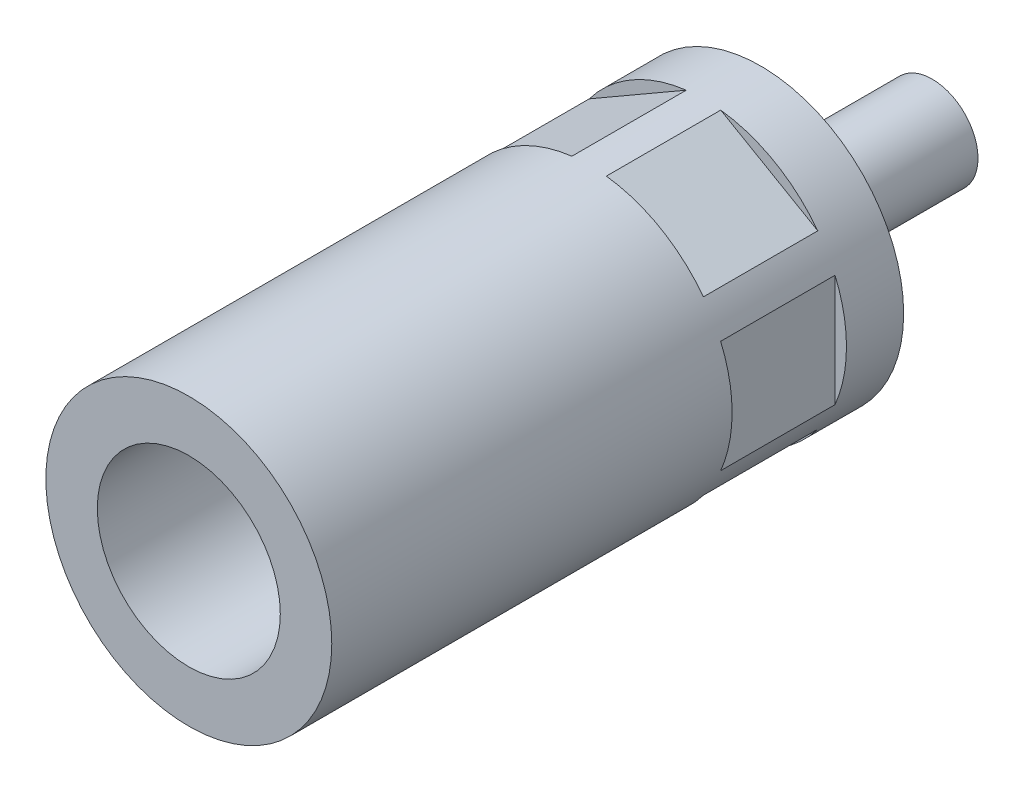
ISO-10303-21;
HEADER;
FILE_DESCRIPTION(('STEP AP214'),'2;1');
FILE_NAME('part.step','',(''),(''),'','','');
FILE_SCHEMA(('AUTOMOTIVE_DESIGN { 1 0 10303 214 1 1 1 1 }'));
ENDSEC;
DATA;
#1=APPLICATION_CONTEXT('core data for automotive mechanical design processes');
#2=APPLICATION_PROTOCOL_DEFINITION('international standard','automotive_design',2000,#1);
#3=PRODUCT_CONTEXT('',#1,'mechanical');
#4=PRODUCT('Part','Part','',(#3));
#5=PRODUCT_RELATED_PRODUCT_CATEGORY('part','',(#4));
#6=PRODUCT_DEFINITION_FORMATION('','',#4);
#7=PRODUCT_DEFINITION_CONTEXT('part definition',#1,'design');
#8=PRODUCT_DEFINITION('design','',#6,#7);
#9=PRODUCT_DEFINITION_SHAPE('','',#8);
#10=(LENGTH_UNIT() NAMED_UNIT(*) SI_UNIT(.MILLI.,.METRE.));
#11=(NAMED_UNIT(*) PLANE_ANGLE_UNIT() SI_UNIT($,.RADIAN.));
#12=(NAMED_UNIT(*) SI_UNIT($,.STERADIAN.) SOLID_ANGLE_UNIT());
#13=UNCERTAINTY_MEASURE_WITH_UNIT(LENGTH_MEASURE(1.E-05),#10,'distance_accuracy_value','');
#14=(GEOMETRIC_REPRESENTATION_CONTEXT(3) GLOBAL_UNCERTAINTY_ASSIGNED_CONTEXT((#13)) GLOBAL_UNIT_ASSIGNED_CONTEXT((#10,
#11,#12)) REPRESENTATION_CONTEXT('',''));
#15=CARTESIAN_POINT('',(0.,0.,0.));
#16=DIRECTION('',(0.,0.,1.));
#17=DIRECTION('',(1.,0.,0.));
#18=AXIS2_PLACEMENT_3D('',#15,#16,#17);
#19=CARTESIAN_POINT('',(0.,0.,80.));
#20=DIRECTION('',(0.,0.,1.));
#21=DIRECTION('',(1.,0.,0.));
#22=AXIS2_PLACEMENT_3D('',#19,#20,#21);
#23=CYLINDRICAL_SURFACE('',#22,25.);
#24=CARTESIAN_POINT('',(0.,0.,10.));
#25=DIRECTION('',(0.,0.,1.));
#26=DIRECTION('',(1.,0.,0.));
#27=AXIS2_PLACEMENT_3D('',#24,#25,#26);
#28=CIRCLE('',#27,25.);
#29=CARTESIAN_POINT('',(-19.9852813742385,-15.0196048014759,10.));
#30=VERTEX_POINT('',#29);
#31=CARTESIAN_POINT('',(-3.01471862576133,-24.8175637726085,10.));
#32=VERTEX_POINT('',#31);
#33=EDGE_CURVE('E153',#30,#32,#28,.T.);
#34=ORIENTED_EDGE('',*,*,#33,.F.);
#35=DIRECTION('',(0.,0.,1.));
#36=VECTOR('',#35,1.);
#37=CARTESIAN_POINT('',(-19.9852813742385,-15.0196048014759,80.));
#38=LINE('',#37,#36);
#39=CARTESIAN_POINT('',(-19.9852813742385,-15.0196048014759,30.));
#40=VERTEX_POINT('',#39);
#41=EDGE_CURVE('E9',#30,#40,#38,.T.);
#42=ORIENTED_EDGE('',*,*,#41,.T.);
#43=CARTESIAN_POINT('',(0.,0.,30.));
#44=DIRECTION('',(0.,0.,1.));
#45=DIRECTION('',(1.,0.,0.));
#46=AXIS2_PLACEMENT_3D('',#43,#44,#45);
#47=CIRCLE('',#46,25.);
#48=CARTESIAN_POINT('',(-3.01471862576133,-24.8175637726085,30.));
#49=VERTEX_POINT('',#48);
#50=EDGE_CURVE('E22',#40,#49,#47,.T.);
#51=ORIENTED_EDGE('',*,*,#50,.T.);
#52=DIRECTION('',(0.,0.,1.));
#53=VECTOR('',#52,1.);
#54=CARTESIAN_POINT('',(-3.01471862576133,-24.8175637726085,80.));
#55=LINE('',#54,#53);
#56=EDGE_CURVE('E150',#49,#32,#55,.F.);
#57=ORIENTED_EDGE('',*,*,#56,.T.);
#58=EDGE_LOOP('',(#34,#42,#51,#57));
#59=FACE_BOUND('',#58,.T.);
#60=DIRECTION('',(0.,0.,1.));
#61=VECTOR('',#60,1.);
#62=CARTESIAN_POINT('',(23.,9.79795897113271,80.));
#63=LINE('',#62,#61);
#64=CARTESIAN_POINT('',(23.,9.79795897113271,10.));
#65=VERTEX_POINT('',#64);
#66=CARTESIAN_POINT('',(23.,9.79795897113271,30.));
#67=VERTEX_POINT('',#66);
#68=EDGE_CURVE('E143',#65,#67,#63,.T.);
#69=ORIENTED_EDGE('',*,*,#68,.F.);
#70=CARTESIAN_POINT('',(23.,-9.79795897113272,10.));
#71=VERTEX_POINT('',#70);
#72=EDGE_CURVE('E142',#71,#65,#28,.T.);
#73=ORIENTED_EDGE('',*,*,#72,.F.);
#74=DIRECTION('',(0.,0.,1.));
#75=VECTOR('',#74,1.);
#76=CARTESIAN_POINT('',(23.,-9.79795897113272,80.));
#77=LINE('',#76,#75);
#78=CARTESIAN_POINT('',(23.,-9.79795897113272,30.));
#79=VERTEX_POINT('',#78);
#80=EDGE_CURVE('E139',#79,#71,#77,.F.);
#81=ORIENTED_EDGE('',*,*,#80,.F.);
#82=EDGE_CURVE('E146',#79,#67,#47,.T.);
#83=ORIENTED_EDGE('',*,*,#82,.T.);
#84=EDGE_LOOP('',(#69,#73,#81,#83));
#85=FACE_BOUND('',#84,.T.);
#86=CARTESIAN_POINT('',(19.9852813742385,15.0196048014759,10.));
#87=VERTEX_POINT('',#86);
#88=CARTESIAN_POINT('',(3.01471862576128,24.8175637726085,10.));
#89=VERTEX_POINT('',#88);
#90=EDGE_CURVE('E135',#87,#89,#28,.T.);
#91=ORIENTED_EDGE('',*,*,#90,.F.);
#92=DIRECTION('',(0.,0.,1.));
#93=VECTOR('',#92,1.);
#94=CARTESIAN_POINT('',(19.9852813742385,15.0196048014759,80.));
#95=LINE('',#94,#93);
#96=CARTESIAN_POINT('',(19.9852813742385,15.0196048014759,30.));
#97=VERTEX_POINT('',#96);
#98=EDGE_CURVE('E136',#87,#97,#95,.T.);
#99=ORIENTED_EDGE('',*,*,#98,.T.);
#100=CARTESIAN_POINT('',(3.01471862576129,24.8175637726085,30.));
#101=VERTEX_POINT('',#100);
#102=EDGE_CURVE('E140',#97,#101,#47,.T.);
#103=ORIENTED_EDGE('',*,*,#102,.T.);
#104=DIRECTION('',(0.,0.,1.));
#105=VECTOR('',#104,1.);
#106=CARTESIAN_POINT('',(3.01471862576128,24.8175637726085,80.));
#107=LINE('',#106,#105);
#108=EDGE_CURVE('E132',#101,#89,#107,.F.);
#109=ORIENTED_EDGE('',*,*,#108,.T.);
#110=EDGE_LOOP('',(#91,#99,#103,#109));
#111=FACE_BOUND('',#110,.T.);
#112=CARTESIAN_POINT('',(0.,0.,0.));
#113=DIRECTION('',(0.,0.,1.));
#114=DIRECTION('',(1.,0.,0.));
#115=AXIS2_PLACEMENT_3D('',#112,#113,#114);
#116=CIRCLE('',#115,25.);
#117=CARTESIAN_POINT('',(25.,0.,0.));
#118=VERTEX_POINT('',#117);
#119=EDGE_CURVE('E202',#118,#118,#116,.T.);
#120=ORIENTED_EDGE('',*,*,#119,.T.);
#121=EDGE_LOOP('',(#120));
#122=FACE_BOUND('',#121,.T.);
#123=CARTESIAN_POINT('',(0.,0.,100.));
#124=DIRECTION('',(0.,0.,1.));
#125=DIRECTION('',(1.,0.,0.));
#126=AXIS2_PLACEMENT_3D('',#123,#124,#125);
#127=CIRCLE('',#126,25.);
#128=CARTESIAN_POINT('',(25.,0.,100.));
#129=VERTEX_POINT('',#128);
#130=EDGE_CURVE('E205',#129,#129,#127,.T.);
#131=ORIENTED_EDGE('',*,*,#130,.F.);
#132=EDGE_LOOP('',(#131));
#133=FACE_BOUND('',#132,.T.);
#134=CARTESIAN_POINT('',(-23.,9.79795897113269,10.));
#135=VERTEX_POINT('',#134);
#136=CARTESIAN_POINT('',(-23.,-9.79795897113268,10.));
#137=VERTEX_POINT('',#136);
#138=EDGE_CURVE('E111',#135,#137,#28,.T.);
#139=ORIENTED_EDGE('',*,*,#138,.F.);
#140=DIRECTION('',(0.,0.,1.));
#141=VECTOR('',#140,1.);
#142=CARTESIAN_POINT('',(-23.,9.79795897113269,80.));
#143=LINE('',#142,#141);
#144=CARTESIAN_POINT('',(-23.,9.79795897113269,30.));
#145=VERTEX_POINT('',#144);
#146=EDGE_CURVE('E110',#135,#145,#143,.T.);
#147=ORIENTED_EDGE('',*,*,#146,.T.);
#148=CARTESIAN_POINT('',(-23.,-9.79795897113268,30.));
#149=VERTEX_POINT('',#148);
#150=EDGE_CURVE('E103',#145,#149,#47,.T.);
#151=ORIENTED_EDGE('',*,*,#150,.T.);
#152=DIRECTION('',(0.,0.,1.));
#153=VECTOR('',#152,1.);
#154=CARTESIAN_POINT('',(-23.,-9.79795897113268,80.));
#155=LINE('',#154,#153);
#156=EDGE_CURVE('E117',#149,#137,#155,.F.);
#157=ORIENTED_EDGE('',*,*,#156,.T.);
#158=EDGE_LOOP('',(#139,#147,#151,#157));
#159=FACE_BOUND('',#158,.T.);
#160=DIRECTION('',(0.,0.,1.));
#161=VECTOR('',#160,1.);
#162=CARTESIAN_POINT('',(-19.9852813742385,15.0196048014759,80.));
#163=LINE('',#162,#161);
#164=CARTESIAN_POINT('',(-19.9852813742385,15.0196048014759,10.));
#165=VERTEX_POINT('',#164);
#166=CARTESIAN_POINT('',(-19.9852813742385,15.0196048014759,30.));
#167=VERTEX_POINT('',#166);
#168=EDGE_CURVE('E130',#165,#167,#163,.T.);
#169=ORIENTED_EDGE('',*,*,#168,.F.);
#170=CARTESIAN_POINT('',(-3.0147186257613,24.8175637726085,10.));
#171=VERTEX_POINT('',#170);
#172=EDGE_CURVE('E126',#171,#165,#28,.T.);
#173=ORIENTED_EDGE('',*,*,#172,.F.);
#174=DIRECTION('',(0.,0.,1.));
#175=VECTOR('',#174,1.);
#176=CARTESIAN_POINT('',(-3.0147186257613,24.8175637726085,80.));
#177=LINE('',#176,#175);
#178=CARTESIAN_POINT('',(-3.0147186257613,24.8175637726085,30.));
#179=VERTEX_POINT('',#178);
#180=EDGE_CURVE('E124',#179,#171,#177,.F.);
#181=ORIENTED_EDGE('',*,*,#180,.F.);
#182=EDGE_CURVE('E113',#179,#167,#47,.T.);
#183=ORIENTED_EDGE('',*,*,#182,.T.);
#184=EDGE_LOOP('',(#169,#173,#181,#183));
#185=FACE_BOUND('',#184,.T.);
#186=DIRECTION('',(0.,0.,1.));
#187=VECTOR('',#186,1.);
#188=CARTESIAN_POINT('',(19.9852813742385,-15.0196048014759,80.));
#189=LINE('',#188,#187);
#190=CARTESIAN_POINT('',(19.9852813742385,-15.0196048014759,10.));
#191=VERTEX_POINT('',#190);
#192=CARTESIAN_POINT('',(19.9852813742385,-15.0196048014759,30.));
#193=VERTEX_POINT('',#192);
#194=EDGE_CURVE('E149',#191,#193,#189,.T.);
#195=ORIENTED_EDGE('',*,*,#194,.F.);
#196=CARTESIAN_POINT('',(3.01471862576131,-24.8175637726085,10.));
#197=VERTEX_POINT('',#196);
#198=EDGE_CURVE('E148',#197,#191,#28,.T.);
#199=ORIENTED_EDGE('',*,*,#198,.F.);
#200=DIRECTION('',(0.,0.,1.));
#201=VECTOR('',#200,1.);
#202=CARTESIAN_POINT('',(3.01471862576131,-24.8175637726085,80.));
#203=LINE('',#202,#201);
#204=CARTESIAN_POINT('',(3.01471862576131,-24.8175637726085,30.));
#205=VERTEX_POINT('',#204);
#206=EDGE_CURVE('E145',#205,#197,#203,.F.);
#207=ORIENTED_EDGE('',*,*,#206,.F.);
#208=EDGE_CURVE('E151',#205,#193,#47,.T.);
#209=ORIENTED_EDGE('',*,*,#208,.T.);
#210=EDGE_LOOP('',(#195,#199,#207,#209));
#211=FACE_BOUND('',#210,.T.);
#212=ADVANCED_FACE('F14',(#59,#85,#111,#122,#133,#159,#185,#211),#23,.T.);
#213=CARTESIAN_POINT('',(0.,0.,-30.));
#214=DIRECTION('',(0.,0.,1.));
#215=DIRECTION('',(1.,0.,0.));
#216=AXIS2_PLACEMENT_3D('',#213,#214,#215);
#217=PLANE('',#216);
#218=CARTESIAN_POINT('',(0.,0.,-30.));
#219=DIRECTION('',(0.,0.,1.));
#220=DIRECTION('',(1.,0.,0.));
#221=AXIS2_PLACEMENT_3D('',#218,#219,#220);
#222=CIRCLE('',#221,8.);
#223=CARTESIAN_POINT('',(8.,0.,-30.));
#224=VERTEX_POINT('',#223);
#225=EDGE_CURVE('E118',#224,#224,#222,.T.);
#226=ORIENTED_EDGE('',*,*,#225,.F.);
#227=EDGE_LOOP('',(#226));
#228=FACE_BOUND('',#227,.T.);
#229=ADVANCED_FACE('F16',(#228),#217,.F.);
#230=CARTESIAN_POINT('',(8.,0.,31.));
#231=DIRECTION('',(0.,0.,-1.));
#232=DIRECTION('',(-1.,0.,0.));
#233=AXIS2_PLACEMENT_3D('',#230,#231,#232);
#234=PLANE('',#233);
#235=CARTESIAN_POINT('',(0.,0.,31.));
#236=DIRECTION('',(0.,0.,1.));
#237=DIRECTION('',(1.,0.,0.));
#238=AXIS2_PLACEMENT_3D('',#235,#236,#237);
#239=CIRCLE('',#238,8.);
#240=CARTESIAN_POINT('',(8.,0.,31.));
#241=VERTEX_POINT('',#240);
#242=EDGE_CURVE('E160',#241,#241,#239,.T.);
#243=ORIENTED_EDGE('',*,*,#242,.T.);
#244=EDGE_LOOP('',(#243));
#245=FACE_BOUND('',#244,.T.);
#246=ADVANCED_FACE('F220',(#245),#234,.F.);
#247=CARTESIAN_POINT('',(0.,0.,80.));
#248=DIRECTION('',(0.,0.,1.));
#249=DIRECTION('',(1.,0.,0.));
#250=AXIS2_PLACEMENT_3D('',#247,#248,#249);
#251=CYLINDRICAL_SURFACE('',#250,8.);
#252=ORIENTED_EDGE('',*,*,#242,.F.);
#253=EDGE_LOOP('',(#252));
#254=FACE_BOUND('',#253,.T.);
#255=CARTESIAN_POINT('',(0.,0.,60.));
#256=DIRECTION('',(0.,0.,1.));
#257=DIRECTION('',(1.,0.,0.));
#258=AXIS2_PLACEMENT_3D('',#255,#256,#257);
#259=CIRCLE('',#258,8.);
#260=CARTESIAN_POINT('',(8.,0.,60.));
#261=VERTEX_POINT('',#260);
#262=EDGE_CURVE('E214',#261,#261,#259,.T.);
#263=ORIENTED_EDGE('',*,*,#262,.T.);
#264=EDGE_LOOP('',(#263));
#265=FACE_BOUND('',#264,.T.);
#266=ADVANCED_FACE('F222',(#254,#265),#251,.F.);
#267=CARTESIAN_POINT('',(8.,0.,60.));
#268=DIRECTION('',(0.,0.,1.));
#269=DIRECTION('',(1.,0.,0.));
#270=AXIS2_PLACEMENT_3D('',#267,#268,#269);
#271=PLANE('',#270);
#272=CARTESIAN_POINT('',(0.,0.,60.));
#273=DIRECTION('',(0.,0.,1.));
#274=DIRECTION('',(1.,0.,0.));
#275=AXIS2_PLACEMENT_3D('',#272,#273,#274);
#276=CIRCLE('',#275,16.);
#277=CARTESIAN_POINT('',(16.,0.,60.));
#278=VERTEX_POINT('',#277);
#279=EDGE_CURVE('E211',#278,#278,#276,.T.);
#280=ORIENTED_EDGE('',*,*,#279,.T.);
#281=EDGE_LOOP('',(#280));
#282=FACE_BOUND('',#281,.T.);
#283=ORIENTED_EDGE('',*,*,#262,.F.);
#284=EDGE_LOOP('',(#283));
#285=FACE_BOUND('',#284,.T.);
#286=ADVANCED_FACE('F225',(#282,#285),#271,.T.);
#287=CARTESIAN_POINT('',(0.,0.,80.));
#288=DIRECTION('',(0.,0.,1.));
#289=DIRECTION('',(1.,0.,0.));
#290=AXIS2_PLACEMENT_3D('',#287,#288,#289);
#291=CYLINDRICAL_SURFACE('',#290,16.);
#292=ORIENTED_EDGE('',*,*,#279,.F.);
#293=EDGE_LOOP('',(#292));
#294=FACE_BOUND('',#293,.T.);
#295=CARTESIAN_POINT('',(0.,0.,100.));
#296=DIRECTION('',(0.,0.,1.));
#297=DIRECTION('',(1.,0.,0.));
#298=AXIS2_PLACEMENT_3D('',#295,#296,#297);
#299=CIRCLE('',#298,16.);
#300=CARTESIAN_POINT('',(16.,0.,100.));
#301=VERTEX_POINT('',#300);
#302=EDGE_CURVE('E208',#301,#301,#299,.T.);
#303=ORIENTED_EDGE('',*,*,#302,.T.);
#304=EDGE_LOOP('',(#303));
#305=FACE_BOUND('',#304,.T.);
#306=ADVANCED_FACE('F230',(#294,#305),#291,.F.);
#307=CARTESIAN_POINT('',(25.,0.,100.));
#308=DIRECTION('',(0.,0.,-1.));
#309=DIRECTION('',(-1.,0.,0.));
#310=AXIS2_PLACEMENT_3D('',#307,#308,#309);
#311=PLANE('',#310);
#312=ORIENTED_EDGE('',*,*,#302,.F.);
#313=EDGE_LOOP('',(#312));
#314=FACE_BOUND('',#313,.T.);
#315=ORIENTED_EDGE('',*,*,#130,.T.);
#316=EDGE_LOOP('',(#315));
#317=FACE_BOUND('',#316,.T.);
#318=ADVANCED_FACE('F238',(#314,#317),#311,.F.);
#319=CARTESIAN_POINT('',(25.,0.,0.));
#320=DIRECTION('',(0.,0.,-1.));
#321=DIRECTION('',(-1.,0.,0.));
#322=AXIS2_PLACEMENT_3D('',#319,#320,#321);
#323=PLANE('',#322);
#324=CARTESIAN_POINT('',(0.,0.,0.));
#325=DIRECTION('',(0.,0.,1.));
#326=DIRECTION('',(1.,0.,0.));
#327=AXIS2_PLACEMENT_3D('',#324,#325,#326);
#328=CIRCLE('',#327,8.);
#329=CARTESIAN_POINT('',(8.,0.,0.));
#330=VERTEX_POINT('',#329);
#331=EDGE_CURVE('E199',#330,#330,#328,.T.);
#332=ORIENTED_EDGE('',*,*,#331,.T.);
#333=EDGE_LOOP('',(#332));
#334=FACE_BOUND('',#333,.T.);
#335=ORIENTED_EDGE('',*,*,#119,.F.);
#336=EDGE_LOOP('',(#335));
#337=FACE_BOUND('',#336,.T.);
#338=ADVANCED_FACE('F250',(#334,#337),#323,.T.);
#339=CARTESIAN_POINT('',(0.,0.,80.));
#340=DIRECTION('',(0.,0.,1.));
#341=DIRECTION('',(1.,0.,0.));
#342=AXIS2_PLACEMENT_3D('',#339,#340,#341);
#343=CYLINDRICAL_SURFACE('',#342,8.);
#344=ORIENTED_EDGE('',*,*,#331,.F.);
#345=EDGE_LOOP('',(#344));
#346=FACE_BOUND('',#345,.T.);
#347=ORIENTED_EDGE('',*,*,#225,.T.);
#348=EDGE_LOOP('',(#347));
#349=FACE_BOUND('',#348,.T.);
#350=ADVANCED_FACE('F258',(#346,#349),#343,.T.);
#351=CARTESIAN_POINT('',(-23.,13.2790561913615,30.));
#352=DIRECTION('',(1.,0.,0.));
#353=DIRECTION('',(0.,1.,0.));
#354=AXIS2_PLACEMENT_3D('',#351,#352,#353);
#355=PLANE('',#354);
#356=DIRECTION('',(0.,-1.,0.));
#357=VECTOR('',#356,1.);
#358=CARTESIAN_POINT('',(-23.,13.2790561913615,10.));
#359=LINE('',#358,#357);
#360=EDGE_CURVE('E193',#135,#137,#359,.T.);
#361=ORIENTED_EDGE('',*,*,#360,.T.);
#362=ORIENTED_EDGE('',*,*,#156,.F.);
#363=DIRECTION('',(0.,-1.,0.));
#364=VECTOR('',#363,1.);
#365=CARTESIAN_POINT('',(-23.,13.2790561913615,30.));
#366=LINE('',#365,#364);
#367=EDGE_CURVE('E106',#145,#149,#366,.T.);
#368=ORIENTED_EDGE('',*,*,#367,.F.);
#369=ORIENTED_EDGE('',*,*,#146,.F.);
#370=EDGE_LOOP('',(#361,#362,#368,#369));
#371=FACE_BOUND('',#370,.T.);
#372=ADVANCED_FACE('F115',(#371),#355,.F.);
#373=CARTESIAN_POINT('',(0.,0.,10.));
#374=DIRECTION('',(0.,0.,1.));
#375=DIRECTION('',(1.,0.,0.));
#376=AXIS2_PLACEMENT_3D('',#373,#374,#375);
#377=PLANE('',#376);
#378=ORIENTED_EDGE('',*,*,#138,.T.);
#379=ORIENTED_EDGE('',*,*,#360,.F.);
#380=EDGE_LOOP('',(#378,#379));
#381=FACE_BOUND('',#380,.T.);
#382=ADVANCED_FACE('F280',(#381),#377,.T.);
#383=CARTESIAN_POINT('',(0.,0.,30.));
#384=DIRECTION('',(0.,0.,1.));
#385=DIRECTION('',(1.,0.,0.));
#386=AXIS2_PLACEMENT_3D('',#383,#384,#385);
#387=PLANE('',#386);
#388=ORIENTED_EDGE('',*,*,#367,.T.);
#389=ORIENTED_EDGE('',*,*,#150,.F.);
#390=EDGE_LOOP('',(#388,#389));
#391=FACE_BOUND('',#390,.T.);
#392=ADVANCED_FACE('F105',(#391),#387,.F.);
#393=CARTESIAN_POINT('',(-23.,13.2790561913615,30.));
#394=DIRECTION('',(-0.5,0.866025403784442,0.));
#395=DIRECTION('',(-0.866025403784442,-0.5,0.));
#396=AXIS2_PLACEMENT_3D('',#393,#394,#395);
#397=PLANE('',#396);
#398=ORIENTED_EDGE('',*,*,#168,.T.);
#399=DIRECTION('',(0.866025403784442,0.5,0.));
#400=VECTOR('',#399,1.);
#401=CARTESIAN_POINT('',(-23.,13.2790561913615,30.));
#402=LINE('',#401,#400);
#403=EDGE_CURVE('E119',#167,#179,#402,.T.);
#404=ORIENTED_EDGE('',*,*,#403,.T.);
#405=ORIENTED_EDGE('',*,*,#180,.T.);
#406=DIRECTION('',(0.866025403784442,0.5,0.));
#407=VECTOR('',#406,1.);
#408=CARTESIAN_POINT('',(-23.,13.2790561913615,10.));
#409=LINE('',#408,#407);
#410=EDGE_CURVE('E344',#165,#171,#409,.T.);
#411=ORIENTED_EDGE('',*,*,#410,.F.);
#412=EDGE_LOOP('',(#398,#404,#405,#411));
#413=FACE_BOUND('',#412,.T.);
#414=ADVANCED_FACE('F306',(#413),#397,.T.);
#415=ORIENTED_EDGE('',*,*,#172,.T.);
#416=ORIENTED_EDGE('',*,*,#410,.T.);
#417=EDGE_LOOP('',(#415,#416));
#418=FACE_BOUND('',#417,.T.);
#419=ADVANCED_FACE('F294',(#418),#377,.T.);
#420=ORIENTED_EDGE('',*,*,#403,.F.);
#421=ORIENTED_EDGE('',*,*,#182,.F.);
#422=EDGE_LOOP('',(#420,#421));
#423=FACE_BOUND('',#422,.T.);
#424=ADVANCED_FACE('F289',(#423),#387,.F.);
#425=CARTESIAN_POINT('',(23.,13.2790561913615,30.));
#426=DIRECTION('',(-0.499999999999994,-0.866025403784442,0.));
#427=DIRECTION('',(0.866025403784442,-0.499999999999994,0.));
#428=AXIS2_PLACEMENT_3D('',#425,#426,#427);
#429=PLANE('',#428);
#430=DIRECTION('',(-0.866025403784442,0.499999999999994,0.));
#431=VECTOR('',#430,1.);
#432=CARTESIAN_POINT('',(23.,13.2790561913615,10.));
#433=LINE('',#432,#431);
#434=EDGE_CURVE('E345',#87,#89,#433,.T.);
#435=ORIENTED_EDGE('',*,*,#434,.T.);
#436=ORIENTED_EDGE('',*,*,#108,.F.);
#437=DIRECTION('',(-0.866025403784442,0.499999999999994,0.));
#438=VECTOR('',#437,1.);
#439=CARTESIAN_POINT('',(23.,13.2790561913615,30.));
#440=LINE('',#439,#438);
#441=EDGE_CURVE('E190',#97,#101,#440,.T.);
#442=ORIENTED_EDGE('',*,*,#441,.F.);
#443=ORIENTED_EDGE('',*,*,#98,.F.);
#444=EDGE_LOOP('',(#435,#436,#442,#443));
#445=FACE_BOUND('',#444,.T.);
#446=ADVANCED_FACE('F293',(#445),#429,.F.);
#447=ORIENTED_EDGE('',*,*,#90,.T.);
#448=ORIENTED_EDGE('',*,*,#434,.F.);
#449=EDGE_LOOP('',(#447,#448));
#450=FACE_BOUND('',#449,.T.);
#451=ADVANCED_FACE('F287',(#450),#377,.T.);
#452=ORIENTED_EDGE('',*,*,#441,.T.);
#453=ORIENTED_EDGE('',*,*,#102,.F.);
#454=EDGE_LOOP('',(#452,#453));
#455=FACE_BOUND('',#454,.T.);
#456=ADVANCED_FACE('F283',(#455),#387,.F.);
#457=CARTESIAN_POINT('',(23.,13.2790561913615,30.));
#458=DIRECTION('',(1.,0.,0.));
#459=DIRECTION('',(0.,1.,0.));
#460=AXIS2_PLACEMENT_3D('',#457,#458,#459);
#461=PLANE('',#460);
#462=ORIENTED_EDGE('',*,*,#68,.T.);
#463=DIRECTION('',(0.,-1.,0.));
#464=VECTOR('',#463,1.);
#465=CARTESIAN_POINT('',(23.,13.2790561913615,30.));
#466=LINE('',#465,#464);
#467=EDGE_CURVE('E187',#67,#79,#466,.T.);
#468=ORIENTED_EDGE('',*,*,#467,.T.);
#469=ORIENTED_EDGE('',*,*,#80,.T.);
#470=DIRECTION('',(0.,-1.,0.));
#471=VECTOR('',#470,1.);
#472=CARTESIAN_POINT('',(23.,13.2790561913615,10.));
#473=LINE('',#472,#471);
#474=EDGE_CURVE('E348',#65,#71,#473,.T.);
#475=ORIENTED_EDGE('',*,*,#474,.F.);
#476=EDGE_LOOP('',(#462,#468,#469,#475));
#477=FACE_BOUND('',#476,.T.);
#478=ADVANCED_FACE('F286',(#477),#461,.T.);
#479=ORIENTED_EDGE('',*,*,#72,.T.);
#480=ORIENTED_EDGE('',*,*,#474,.T.);
#481=EDGE_LOOP('',(#479,#480));
#482=FACE_BOUND('',#481,.T.);
#483=ADVANCED_FACE('F295',(#482),#377,.T.);
#484=ORIENTED_EDGE('',*,*,#467,.F.);
#485=ORIENTED_EDGE('',*,*,#82,.F.);
#486=EDGE_LOOP('',(#484,#485));
#487=FACE_BOUND('',#486,.T.);
#488=ADVANCED_FACE('F290',(#487),#387,.F.);
#489=CARTESIAN_POINT('',(23.,-13.2790561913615,30.));
#490=DIRECTION('',(0.5,-0.866025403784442,0.));
#491=DIRECTION('',(0.866025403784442,0.5,0.));
#492=AXIS2_PLACEMENT_3D('',#489,#490,#491);
#493=PLANE('',#492);
#494=ORIENTED_EDGE('',*,*,#194,.T.);
#495=DIRECTION('',(-0.866025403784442,-0.5,0.));
#496=VECTOR('',#495,1.);
#497=CARTESIAN_POINT('',(23.,-13.2790561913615,30.));
#498=LINE('',#497,#496);
#499=EDGE_CURVE('E37',#193,#205,#498,.T.);
#500=ORIENTED_EDGE('',*,*,#499,.T.);
#501=ORIENTED_EDGE('',*,*,#206,.T.);
#502=DIRECTION('',(-0.866025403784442,-0.5,0.));
#503=VECTOR('',#502,1.);
#504=CARTESIAN_POINT('',(23.,-13.2790561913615,10.));
#505=LINE('',#504,#503);
#506=EDGE_CURVE('E352',#191,#197,#505,.T.);
#507=ORIENTED_EDGE('',*,*,#506,.F.);
#508=EDGE_LOOP('',(#494,#500,#501,#507));
#509=FACE_BOUND('',#508,.T.);
#510=ADVANCED_FACE('F296',(#509),#493,.T.);
#511=ORIENTED_EDGE('',*,*,#198,.T.);
#512=ORIENTED_EDGE('',*,*,#506,.T.);
#513=EDGE_LOOP('',(#511,#512));
#514=FACE_BOUND('',#513,.T.);
#515=ADVANCED_FACE('F299',(#514),#377,.T.);
#516=ORIENTED_EDGE('',*,*,#499,.F.);
#517=ORIENTED_EDGE('',*,*,#208,.F.);
#518=EDGE_LOOP('',(#516,#517));
#519=FACE_BOUND('',#518,.T.);
#520=ADVANCED_FACE('F186',(#519),#387,.F.);
#521=DIRECTION('',(0.866025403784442,-0.5,0.));
#522=VECTOR('',#521,1.);
#523=CARTESIAN_POINT('',(-23.,-13.2790561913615,30.));
#524=LINE('',#523,#522);
#525=EDGE_CURVE('E188',#40,#49,#524,.T.);
#526=ORIENTED_EDGE('',*,*,#525,.T.);
#527=ORIENTED_EDGE('',*,*,#50,.F.);
#528=EDGE_LOOP('',(#526,#527));
#529=FACE_BOUND('',#528,.T.);
#530=ADVANCED_FACE('F317',(#529),#387,.F.);
#531=ORIENTED_EDGE('',*,*,#33,.T.);
#532=DIRECTION('',(0.866025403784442,-0.5,0.));
#533=VECTOR('',#532,1.);
#534=CARTESIAN_POINT('',(-23.,-13.2790561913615,10.));
#535=LINE('',#534,#533);
#536=EDGE_CURVE('E29',#30,#32,#535,.T.);
#537=ORIENTED_EDGE('',*,*,#536,.F.);
#538=EDGE_LOOP('',(#531,#537));
#539=FACE_BOUND('',#538,.T.);
#540=ADVANCED_FACE('F312',(#539),#377,.T.);
#541=CARTESIAN_POINT('',(-23.,-13.2790561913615,30.));
#542=DIRECTION('',(0.5,0.866025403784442,0.));
#543=DIRECTION('',(-0.866025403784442,0.5,0.));
#544=AXIS2_PLACEMENT_3D('',#541,#542,#543);
#545=PLANE('',#544);
#546=ORIENTED_EDGE('',*,*,#536,.T.);
#547=ORIENTED_EDGE('',*,*,#56,.F.);
#548=ORIENTED_EDGE('',*,*,#525,.F.);
#549=ORIENTED_EDGE('',*,*,#41,.F.);
#550=EDGE_LOOP('',(#546,#547,#548,#549));
#551=FACE_BOUND('',#550,.T.);
#552=ADVANCED_FACE('F310',(#551),#545,.F.);
#553=CLOSED_SHELL('',(#212,#229,#246,#266,#286,#306,#318,#338,#350,#372,#382,#392,#414,#419,
#424,#446,#451,#456,#478,#483,#488,#510,#515,#520,#530,#540,#552));
#554=MANIFOLD_SOLID_BREP('B1',#553);
#555=ADVANCED_BREP_SHAPE_REPRESENTATION('',(#18,#554),#14);
#556=SHAPE_DEFINITION_REPRESENTATION(#9,#555);
ENDSEC;
END-ISO-10303-21;
